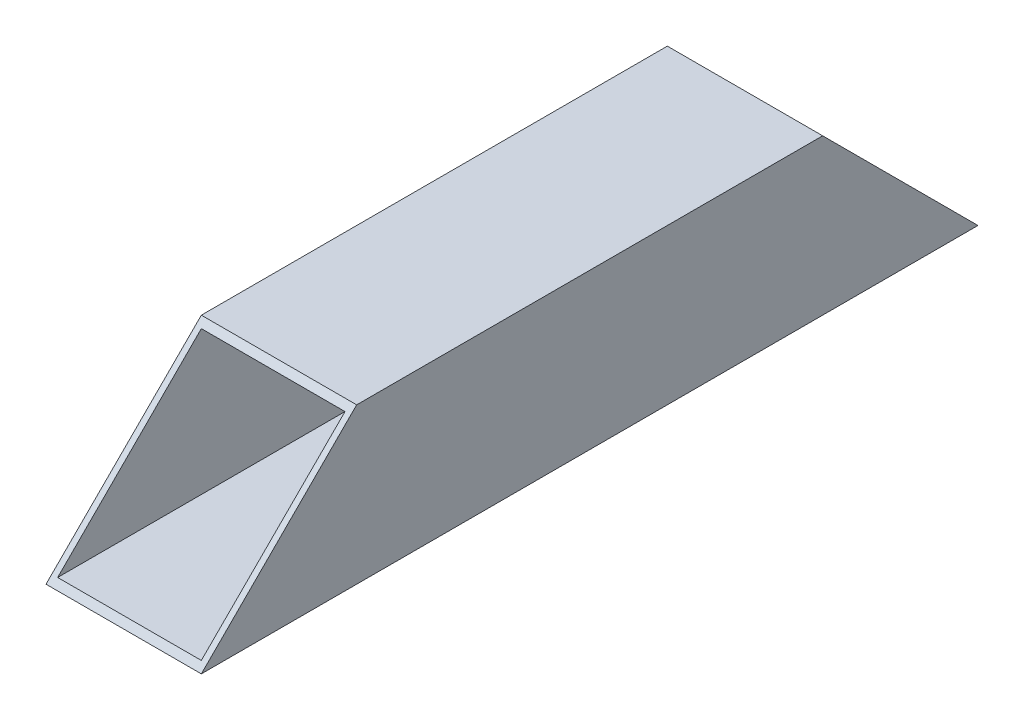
ISO-10303-21;
HEADER;
FILE_DESCRIPTION(('STEP AP214'),'2;1');
FILE_NAME('part.step','',(''),(''),'','','');
FILE_SCHEMA(('AUTOMOTIVE_DESIGN { 1 0 10303 214 1 1 1 1 }'));
ENDSEC;
DATA;
#1=APPLICATION_CONTEXT('core data for automotive mechanical design processes');
#2=APPLICATION_PROTOCOL_DEFINITION('international standard','automotive_design',2000,#1);
#3=PRODUCT_CONTEXT('',#1,'mechanical');
#4=PRODUCT('Part','Part','',(#3));
#5=PRODUCT_RELATED_PRODUCT_CATEGORY('part','',(#4));
#6=PRODUCT_DEFINITION_FORMATION('','',#4);
#7=PRODUCT_DEFINITION_CONTEXT('part definition',#1,'design');
#8=PRODUCT_DEFINITION('design','',#6,#7);
#9=PRODUCT_DEFINITION_SHAPE('','',#8);
#10=(LENGTH_UNIT() NAMED_UNIT(*) SI_UNIT(.MILLI.,.METRE.));
#11=(NAMED_UNIT(*) PLANE_ANGLE_UNIT() SI_UNIT($,.RADIAN.));
#12=(NAMED_UNIT(*) SI_UNIT($,.STERADIAN.) SOLID_ANGLE_UNIT());
#13=UNCERTAINTY_MEASURE_WITH_UNIT(LENGTH_MEASURE(1.E-05),#10,'distance_accuracy_value','');
#14=(GEOMETRIC_REPRESENTATION_CONTEXT(3) GLOBAL_UNCERTAINTY_ASSIGNED_CONTEXT((#13)) GLOBAL_UNIT_ASSIGNED_CONTEXT((#10,
#11,#12)) REPRESENTATION_CONTEXT('',''));
#15=CARTESIAN_POINT('',(0.,0.,0.));
#16=DIRECTION('',(0.,0.,1.));
#17=DIRECTION('',(1.,0.,0.));
#18=AXIS2_PLACEMENT_3D('',#15,#16,#17);
#19=CARTESIAN_POINT('',(0.,0.,400.));
#20=DIRECTION('',(-1.,0.,0.));
#21=DIRECTION('',(0.,0.,1.));
#22=AXIS2_PLACEMENT_3D('',#19,#20,#21);
#23=PLANE('',#22);
#24=DIRECTION('',(0.,0.,-1.));
#25=VECTOR('',#24,1.);
#26=CARTESIAN_POINT('',(0.,80.,400.));
#27=LINE('',#26,#25);
#28=CARTESIAN_POINT('',(0.,80.,320.));
#29=VERTEX_POINT('',#28);
#30=CARTESIAN_POINT('',(0.,80.,80.));
#31=VERTEX_POINT('',#30);
#32=EDGE_CURVE('E121',#29,#31,#27,.T.);
#33=ORIENTED_EDGE('',*,*,#32,.F.);
#34=DIRECTION('',(0.,-0.707106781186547,0.707106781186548));
#35=VECTOR('',#34,1.);
#36=CARTESIAN_POINT('',(0.,0.,400.));
#37=LINE('',#36,#35);
#38=CARTESIAN_POINT('',(0.,0.,400.));
#39=VERTEX_POINT('',#38);
#40=EDGE_CURVE('E102',#29,#39,#37,.T.);
#41=ORIENTED_EDGE('',*,*,#40,.T.);
#42=DIRECTION('',(0.,0.,-1.));
#43=VECTOR('',#42,1.);
#44=CARTESIAN_POINT('',(0.,0.,400.));
#45=LINE('',#44,#43);
#46=CARTESIAN_POINT('',(0.,0.,0.));
#47=VERTEX_POINT('',#46);
#48=EDGE_CURVE('E124',#39,#47,#45,.T.);
#49=ORIENTED_EDGE('',*,*,#48,.T.);
#50=DIRECTION('',(0.,0.707106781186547,0.707106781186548));
#51=VECTOR('',#50,1.);
#52=CARTESIAN_POINT('',(0.,200.,200.));
#53=LINE('',#52,#51);
#54=EDGE_CURVE('E145',#47,#31,#53,.T.);
#55=ORIENTED_EDGE('',*,*,#54,.T.);
#56=EDGE_LOOP('',(#33,#41,#49,#55));
#57=FACE_BOUND('',#56,.T.);
#58=ADVANCED_FACE('F32',(#57),#23,.F.);
#59=CARTESIAN_POINT('',(0.,80.,400.));
#60=DIRECTION('',(0.,-1.,0.));
#61=DIRECTION('',(1.,0.,0.));
#62=AXIS2_PLACEMENT_3D('',#59,#60,#61);
#63=PLANE('',#62);
#64=DIRECTION('',(0.,0.,-1.));
#65=VECTOR('',#64,1.);
#66=CARTESIAN_POINT('',(-80.,80.,400.));
#67=LINE('',#66,#65);
#68=CARTESIAN_POINT('',(-80.,80.,320.));
#69=VERTEX_POINT('',#68);
#70=CARTESIAN_POINT('',(-80.,80.,80.));
#71=VERTEX_POINT('',#70);
#72=EDGE_CURVE('E111',#69,#71,#67,.T.);
#73=ORIENTED_EDGE('',*,*,#72,.F.);
#74=DIRECTION('',(-1.,0.,0.));
#75=VECTOR('',#74,1.);
#76=CARTESIAN_POINT('',(720.,80.0000000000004,320.));
#77=LINE('',#76,#75);
#78=EDGE_CURVE('E96',#29,#69,#77,.T.);
#79=ORIENTED_EDGE('',*,*,#78,.F.);
#80=ORIENTED_EDGE('',*,*,#32,.T.);
#81=DIRECTION('',(-1.,0.,0.));
#82=VECTOR('',#81,1.);
#83=CARTESIAN_POINT('',(720.,80.0000000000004,80.));
#84=LINE('',#83,#82);
#85=EDGE_CURVE('E120',#31,#71,#84,.T.);
#86=ORIENTED_EDGE('',*,*,#85,.T.);
#87=EDGE_LOOP('',(#73,#79,#80,#86));
#88=FACE_BOUND('',#87,.T.);
#89=ADVANCED_FACE('F118',(#88),#63,.F.);
#90=CARTESIAN_POINT('',(-80.,0.,400.));
#91=DIRECTION('',(1.,0.,0.));
#92=DIRECTION('',(0.,0.,-1.));
#93=AXIS2_PLACEMENT_3D('',#90,#91,#92);
#94=PLANE('',#93);
#95=DIRECTION('',(0.,0.,-1.));
#96=VECTOR('',#95,1.);
#97=CARTESIAN_POINT('',(-80.,0.,400.));
#98=LINE('',#97,#96);
#99=CARTESIAN_POINT('',(-80.,0.,400.));
#100=VERTEX_POINT('',#99);
#101=CARTESIAN_POINT('',(-80.,0.,0.));
#102=VERTEX_POINT('',#101);
#103=EDGE_CURVE('E114',#100,#102,#98,.T.);
#104=ORIENTED_EDGE('',*,*,#103,.F.);
#105=DIRECTION('',(0.,-0.707106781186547,0.707106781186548));
#106=VECTOR('',#105,1.);
#107=CARTESIAN_POINT('',(-80.,80.,320.));
#108=LINE('',#107,#106);
#109=EDGE_CURVE('E99',#69,#100,#108,.T.);
#110=ORIENTED_EDGE('',*,*,#109,.F.);
#111=ORIENTED_EDGE('',*,*,#72,.T.);
#112=DIRECTION('',(0.,0.707106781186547,0.707106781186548));
#113=VECTOR('',#112,1.);
#114=CARTESIAN_POINT('',(-80.,80.,80.));
#115=LINE('',#114,#113);
#116=EDGE_CURVE('E167',#102,#71,#115,.T.);
#117=ORIENTED_EDGE('',*,*,#116,.F.);
#118=EDGE_LOOP('',(#104,#110,#111,#117));
#119=FACE_BOUND('',#118,.T.);
#120=ADVANCED_FACE('F109',(#119),#94,.F.);
#121=CARTESIAN_POINT('',(0.,0.,400.));
#122=DIRECTION('',(0.,1.,0.));
#123=DIRECTION('',(-1.,0.,0.));
#124=AXIS2_PLACEMENT_3D('',#121,#122,#123);
#125=PLANE('',#124);
#126=DIRECTION('',(1.,0.,0.));
#127=VECTOR('',#126,1.);
#128=CARTESIAN_POINT('',(0.,0.,0.));
#129=LINE('',#128,#127);
#130=EDGE_CURVE('E158',#102,#47,#129,.T.);
#131=ORIENTED_EDGE('',*,*,#130,.T.);
#132=ORIENTED_EDGE('',*,*,#48,.F.);
#133=DIRECTION('',(1.,0.,0.));
#134=VECTOR('',#133,1.);
#135=CARTESIAN_POINT('',(0.,0.,400.));
#136=LINE('',#135,#134);
#137=EDGE_CURVE('E161',#100,#39,#136,.T.);
#138=ORIENTED_EDGE('',*,*,#137,.F.);
#139=ORIENTED_EDGE('',*,*,#103,.T.);
#140=EDGE_LOOP('',(#131,#132,#138,#139));
#141=FACE_BOUND('',#140,.T.);
#142=ADVANCED_FACE('F166',(#141),#125,.F.);
#143=CARTESIAN_POINT('',(-77.,77.,400.));
#144=DIRECTION('',(1.,0.,0.));
#145=DIRECTION('',(0.,1.,0.));
#146=AXIS2_PLACEMENT_3D('',#143,#144,#145);
#147=PLANE('',#146);
#148=DIRECTION('',(0.,0.707106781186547,-0.707106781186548));
#149=VECTOR('',#148,1.);
#150=CARTESIAN_POINT('',(-77.,38.5,361.5));
#151=LINE('',#150,#149);
#152=CARTESIAN_POINT('',(-77.,3.,397.));
#153=VERTEX_POINT('',#152);
#154=CARTESIAN_POINT('',(-77.,77.,323.));
#155=VERTEX_POINT('',#154);
#156=EDGE_CURVE('E45',#153,#155,#151,.T.);
#157=ORIENTED_EDGE('',*,*,#156,.F.);
#158=DIRECTION('',(0.,0.,-1.));
#159=VECTOR('',#158,1.);
#160=CARTESIAN_POINT('',(-77.,3.,400.));
#161=LINE('',#160,#159);
#162=CARTESIAN_POINT('',(-77.,3.,3.00000000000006));
#163=VERTEX_POINT('',#162);
#164=EDGE_CURVE('E144',#153,#163,#161,.T.);
#165=ORIENTED_EDGE('',*,*,#164,.T.);
#166=DIRECTION('',(0.,-0.707106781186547,-0.707106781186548));
#167=VECTOR('',#166,1.);
#168=CARTESIAN_POINT('',(-77.,238.5,238.5));
#169=LINE('',#168,#167);
#170=CARTESIAN_POINT('',(-77.,77.,77.0000000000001));
#171=VERTEX_POINT('',#170);
#172=EDGE_CURVE('E135',#171,#163,#169,.T.);
#173=ORIENTED_EDGE('',*,*,#172,.F.);
#174=DIRECTION('',(0.,0.,-1.));
#175=VECTOR('',#174,1.);
#176=CARTESIAN_POINT('',(-77.,77.,400.));
#177=LINE('',#176,#175);
#178=EDGE_CURVE('E142',#155,#171,#177,.T.);
#179=ORIENTED_EDGE('',*,*,#178,.F.);
#180=EDGE_LOOP('',(#157,#165,#173,#179));
#181=FACE_BOUND('',#180,.T.);
#182=ADVANCED_FACE('F141',(#181),#147,.T.);
#183=CARTESIAN_POINT('',(-77.,3.,400.));
#184=DIRECTION('',(0.,1.,0.));
#185=DIRECTION('',(0.,0.,1.));
#186=AXIS2_PLACEMENT_3D('',#183,#184,#185);
#187=PLANE('',#186);
#188=DIRECTION('',(-1.,0.,0.));
#189=VECTOR('',#188,1.);
#190=CARTESIAN_POINT('',(-77.,3.,397.));
#191=LINE('',#190,#189);
#192=CARTESIAN_POINT('',(-3.,3.,397.));
#193=VERTEX_POINT('',#192);
#194=EDGE_CURVE('E173',#193,#153,#191,.T.);
#195=ORIENTED_EDGE('',*,*,#194,.F.);
#196=DIRECTION('',(0.,0.,-1.));
#197=VECTOR('',#196,1.);
#198=CARTESIAN_POINT('',(-3.,3.,400.));
#199=LINE('',#198,#197);
#200=CARTESIAN_POINT('',(-3.,3.00000000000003,3.00000000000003));
#201=VERTEX_POINT('',#200);
#202=EDGE_CURVE('E155',#193,#201,#199,.T.);
#203=ORIENTED_EDGE('',*,*,#202,.T.);
#204=DIRECTION('',(1.,0.,0.));
#205=VECTOR('',#204,1.);
#206=CARTESIAN_POINT('',(-77.0000000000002,3.,3.00000000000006));
#207=LINE('',#206,#205);
#208=EDGE_CURVE('E146',#163,#201,#207,.T.);
#209=ORIENTED_EDGE('',*,*,#208,.F.);
#210=ORIENTED_EDGE('',*,*,#164,.F.);
#211=EDGE_LOOP('',(#195,#203,#209,#210));
#212=FACE_BOUND('',#211,.T.);
#213=ADVANCED_FACE('F178',(#212),#187,.T.);
#214=CARTESIAN_POINT('',(-3.,77.,400.));
#215=DIRECTION('',(-1.,0.,0.));
#216=DIRECTION('',(0.,-1.,0.));
#217=AXIS2_PLACEMENT_3D('',#214,#215,#216);
#218=PLANE('',#217);
#219=DIRECTION('',(0.,-0.707106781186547,0.707106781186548));
#220=VECTOR('',#219,1.);
#221=CARTESIAN_POINT('',(-3.,38.5,361.5));
#222=LINE('',#221,#220);
#223=CARTESIAN_POINT('',(-3.,77.,323.));
#224=VERTEX_POINT('',#223);
#225=EDGE_CURVE('E106',#224,#193,#222,.T.);
#226=ORIENTED_EDGE('',*,*,#225,.F.);
#227=DIRECTION('',(0.,0.,-1.));
#228=VECTOR('',#227,1.);
#229=CARTESIAN_POINT('',(-3.,77.,400.));
#230=LINE('',#229,#228);
#231=CARTESIAN_POINT('',(-3.,77.,77.0000000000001));
#232=VERTEX_POINT('',#231);
#233=EDGE_CURVE('E53',#224,#232,#230,.T.);
#234=ORIENTED_EDGE('',*,*,#233,.T.);
#235=DIRECTION('',(0.,0.707106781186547,0.707106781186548));
#236=VECTOR('',#235,1.);
#237=CARTESIAN_POINT('',(-3.00000000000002,238.5,238.5));
#238=LINE('',#237,#236);
#239=EDGE_CURVE('E137',#201,#232,#238,.T.);
#240=ORIENTED_EDGE('',*,*,#239,.F.);
#241=ORIENTED_EDGE('',*,*,#202,.F.);
#242=EDGE_LOOP('',(#226,#234,#240,#241));
#243=FACE_BOUND('',#242,.T.);
#244=ADVANCED_FACE('F179',(#243),#218,.T.);
#245=CARTESIAN_POINT('',(-77.,77.,400.));
#246=DIRECTION('',(0.,-1.,0.));
#247=DIRECTION('',(0.,0.,-1.));
#248=AXIS2_PLACEMENT_3D('',#245,#246,#247);
#249=PLANE('',#248);
#250=DIRECTION('',(1.,0.,0.));
#251=VECTOR('',#250,1.);
#252=CARTESIAN_POINT('',(-77.,77.,323.));
#253=LINE('',#252,#251);
#254=EDGE_CURVE('E11',#155,#224,#253,.T.);
#255=ORIENTED_EDGE('',*,*,#254,.F.);
#256=ORIENTED_EDGE('',*,*,#178,.T.);
#257=DIRECTION('',(-1.,0.,0.));
#258=VECTOR('',#257,1.);
#259=CARTESIAN_POINT('',(-77.0000000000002,77.,77.0000000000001));
#260=LINE('',#259,#258);
#261=EDGE_CURVE('E39',#232,#171,#260,.T.);
#262=ORIENTED_EDGE('',*,*,#261,.F.);
#263=ORIENTED_EDGE('',*,*,#233,.F.);
#264=EDGE_LOOP('',(#255,#256,#262,#263));
#265=FACE_BOUND('',#264,.T.);
#266=ADVANCED_FACE('F181',(#265),#249,.T.);
#267=CARTESIAN_POINT('',(720.,80.0000000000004,80.));
#268=DIRECTION('',(0.,-0.707106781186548,0.707106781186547));
#269=DIRECTION('',(0.,-0.707106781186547,-0.707106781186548));
#270=AXIS2_PLACEMENT_3D('',#267,#268,#269);
#271=PLANE('',#270);
#272=ORIENTED_EDGE('',*,*,#172,.T.);
#273=ORIENTED_EDGE('',*,*,#208,.T.);
#274=ORIENTED_EDGE('',*,*,#239,.T.);
#275=ORIENTED_EDGE('',*,*,#261,.T.);
#276=EDGE_LOOP('',(#272,#273,#274,#275));
#277=FACE_BOUND('',#276,.T.);
#278=ORIENTED_EDGE('',*,*,#130,.F.);
#279=ORIENTED_EDGE('',*,*,#116,.T.);
#280=ORIENTED_EDGE('',*,*,#85,.F.);
#281=ORIENTED_EDGE('',*,*,#54,.F.);
#282=EDGE_LOOP('',(#278,#279,#280,#281));
#283=FACE_BOUND('',#282,.T.);
#284=ADVANCED_FACE('F132',(#277,#283),#271,.F.);
#285=CARTESIAN_POINT('',(720.,80.0000000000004,320.));
#286=DIRECTION('',(0.,-0.707106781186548,-0.707106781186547));
#287=DIRECTION('',(0.,0.707106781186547,-0.707106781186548));
#288=AXIS2_PLACEMENT_3D('',#285,#286,#287);
#289=PLANE('',#288);
#290=ORIENTED_EDGE('',*,*,#156,.T.);
#291=ORIENTED_EDGE('',*,*,#254,.T.);
#292=ORIENTED_EDGE('',*,*,#225,.T.);
#293=ORIENTED_EDGE('',*,*,#194,.T.);
#294=EDGE_LOOP('',(#290,#291,#292,#293));
#295=FACE_BOUND('',#294,.T.);
#296=ORIENTED_EDGE('',*,*,#78,.T.);
#297=ORIENTED_EDGE('',*,*,#109,.T.);
#298=ORIENTED_EDGE('',*,*,#137,.T.);
#299=ORIENTED_EDGE('',*,*,#40,.F.);
#300=EDGE_LOOP('',(#296,#297,#298,#299));
#301=FACE_BOUND('',#300,.T.);
#302=ADVANCED_FACE('F98',(#295,#301),#289,.F.);
#303=CLOSED_SHELL('',(#58,#89,#120,#142,#182,#213,#244,#266,#284,#302));
#304=MANIFOLD_SOLID_BREP('B2',#303);
#305=ADVANCED_BREP_SHAPE_REPRESENTATION('',(#18,#304),#14);
#306=SHAPE_DEFINITION_REPRESENTATION(#9,#305);
ENDSEC;
END-ISO-10303-21;
